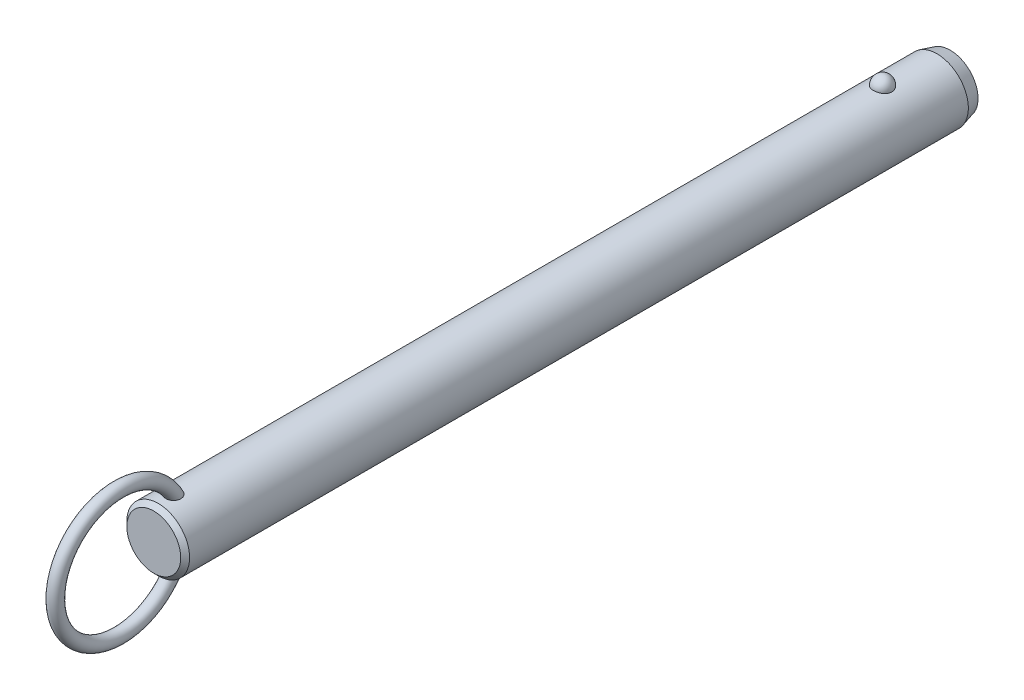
ISO-10303-21;
HEADER;
FILE_DESCRIPTION(('STEP AP214'),'2;1');
FILE_NAME('part.step','',(''),(''),'','','');
FILE_SCHEMA(('AUTOMOTIVE_DESIGN { 1 0 10303 214 1 1 1 1 }'));
ENDSEC;
DATA;
#1=APPLICATION_CONTEXT('core data for automotive mechanical design processes');
#2=APPLICATION_PROTOCOL_DEFINITION('international standard','automotive_design',2000,#1);
#3=PRODUCT_CONTEXT('',#1,'mechanical');
#4=PRODUCT('Part','Part','',(#3));
#5=PRODUCT_RELATED_PRODUCT_CATEGORY('part','',(#4));
#6=PRODUCT_DEFINITION_FORMATION('','',#4);
#7=PRODUCT_DEFINITION_CONTEXT('part definition',#1,'design');
#8=PRODUCT_DEFINITION('design','',#6,#7);
#9=PRODUCT_DEFINITION_SHAPE('','',#8);
#10=(LENGTH_UNIT() NAMED_UNIT(*) SI_UNIT(.MILLI.,.METRE.));
#11=(NAMED_UNIT(*) PLANE_ANGLE_UNIT() SI_UNIT($,.RADIAN.));
#12=(NAMED_UNIT(*) SI_UNIT($,.STERADIAN.) SOLID_ANGLE_UNIT());
#13=UNCERTAINTY_MEASURE_WITH_UNIT(LENGTH_MEASURE(1.E-05),#10,'distance_accuracy_value','');
#14=(GEOMETRIC_REPRESENTATION_CONTEXT(3) GLOBAL_UNCERTAINTY_ASSIGNED_CONTEXT((#13)) GLOBAL_UNIT_ASSIGNED_CONTEXT((#10,
#11,#12)) REPRESENTATION_CONTEXT('',''));
#15=CARTESIAN_POINT('',(0.,0.,0.));
#16=DIRECTION('',(0.,0.,1.));
#17=DIRECTION('',(1.,0.,0.));
#18=AXIS2_PLACEMENT_3D('',#15,#16,#17);
#19=CARTESIAN_POINT('',(0.,0.,154.9));
#20=DIRECTION('',(0.,0.,-1.));
#21=DIRECTION('',(-1.,0.,0.));
#22=AXIS2_PLACEMENT_3D('',#19,#20,#21);
#23=CYLINDRICAL_SURFACE('',#22,7.1);
#24=CARTESIAN_POINT('',(2.0769088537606,6.78943661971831,-2.1));
#25=CARTESIAN_POINT('',(2.07690739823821,6.78943796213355,-1.98268154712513));
#26=CARTESIAN_POINT('',(2.06738130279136,6.79237331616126,-1.86534506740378));
#27=CARTESIAN_POINT('',(2.0295040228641,6.8037853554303,-1.63400788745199));
#28=CARTESIAN_POINT('',(2.00114757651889,6.81226358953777,-1.52000812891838));
#29=CARTESIAN_POINT('',(1.92632025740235,6.83379798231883,-1.29863433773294));
#30=CARTESIAN_POINT('',(1.87985726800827,6.84685214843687,-1.19125744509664));
#31=CARTESIAN_POINT('',(1.76995205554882,6.87608091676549,-0.98604657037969));
#32=CARTESIAN_POINT('',(1.70650980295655,6.8922555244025,-0.88821260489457));
#33=CARTESIAN_POINT('',(1.5638119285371,6.92602930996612,-0.704242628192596));
#34=CARTESIAN_POINT('',(1.4844714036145,6.94363582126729,-0.618173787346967));
#35=CARTESIAN_POINT('',(1.31221746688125,6.97823658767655,-0.460740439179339));
#36=CARTESIAN_POINT('',(1.21930409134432,6.99523084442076,-0.389375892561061));
#37=CARTESIAN_POINT('',(1.02268781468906,7.02666176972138,-0.263547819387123));
#38=CARTESIAN_POINT('',(0.91902009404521,7.04110638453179,-0.209031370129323));
#39=CARTESIAN_POINT('',(0.703548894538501,7.06588726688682,-0.118163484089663));
#40=CARTESIAN_POINT('',(0.591746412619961,7.07622403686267,-0.0818098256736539));
#41=CARTESIAN_POINT('',(0.365557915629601,7.09147068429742,-0.0288711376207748));
#42=CARTESIAN_POINT('',(0.251267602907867,7.09648447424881,-0.0119070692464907));
#43=CARTESIAN_POINT('',(0.0213499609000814,7.10089837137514,0.00304925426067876));
#44=CARTESIAN_POINT('',(-0.0942772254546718,7.10029907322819,0.00104351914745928));
#45=CARTESIAN_POINT('',(-0.321651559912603,7.09360829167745,-0.0216931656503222));
#46=CARTESIAN_POINT('',(-0.433431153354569,7.08760388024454,-0.0421272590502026));
#47=CARTESIAN_POINT('',(-0.651862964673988,7.07086131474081,-0.100729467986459));
#48=CARTESIAN_POINT('',(-0.758515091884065,7.06012307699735,-0.138897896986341));
#49=CARTESIAN_POINT('',(-0.964449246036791,7.03496097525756,-0.232213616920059));
#50=CARTESIAN_POINT('',(-1.06368095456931,7.02051445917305,-0.287465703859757));
#51=CARTESIAN_POINT('',(-1.25145353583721,6.98948740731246,-0.413383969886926));
#52=CARTESIAN_POINT('',(-1.33999321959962,6.97290663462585,-0.48405186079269));
#53=CARTESIAN_POINT('',(-1.50591604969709,6.93898770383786,-0.640594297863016));
#54=CARTESIAN_POINT('',(-1.58302488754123,6.92164094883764,-0.726757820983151));
#55=CARTESIAN_POINT('',(-1.72189320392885,6.8884103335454,-0.91092752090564));
#56=CARTESIAN_POINT('',(-1.78365144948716,6.87252659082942,-1.008934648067));
#57=CARTESIAN_POINT('',(-1.89101272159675,6.84377189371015,-1.21549497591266));
#58=CARTESIAN_POINT('',(-1.93639553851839,6.83094274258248,-1.32416860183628));
#59=CARTESIAN_POINT('',(-2.00874275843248,6.81002070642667,-1.54791500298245));
#60=CARTESIAN_POINT('',(-2.03570774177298,6.80192767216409,-1.66298757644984));
#61=CARTESIAN_POINT('',(-2.07047276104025,6.7914266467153,-1.89571453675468));
#62=CARTESIAN_POINT('',(-2.07835878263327,6.78899315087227,-2.01335491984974));
#63=CARTESIAN_POINT('',(-2.07502083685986,6.79001409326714,-2.24833570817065));
#64=CARTESIAN_POINT('',(-2.06379746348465,6.7934683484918,-2.36567612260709));
#65=CARTESIAN_POINT('',(-2.02263913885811,6.80583442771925,-2.59603194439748));
#66=CARTESIAN_POINT('',(-1.99281127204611,6.81471501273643,-2.70906820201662));
#67=CARTESIAN_POINT('',(-1.91526639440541,6.83691232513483,-2.92836575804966));
#68=CARTESIAN_POINT('',(-1.8675486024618,6.85022924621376,-3.03462676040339));
#69=CARTESIAN_POINT('',(-1.75504492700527,6.87991336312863,-3.23806487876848));
#70=CARTESIAN_POINT('',(-1.69015924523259,6.89629822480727,-3.33518422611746));
#71=CARTESIAN_POINT('',(-1.54505404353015,6.93024852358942,-3.51697105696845));
#72=CARTESIAN_POINT('',(-1.46483385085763,6.94781401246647,-3.60163799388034));
#73=CARTESIAN_POINT('',(-1.29071406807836,6.98225977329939,-3.75654119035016));
#74=CARTESIAN_POINT('',(-1.19675650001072,6.99913673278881,-3.82671308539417));
#75=CARTESIAN_POINT('',(-0.997940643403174,7.03023618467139,-3.9501837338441));
#76=CARTESIAN_POINT('',(-0.89308318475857,7.04445887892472,-4.00348377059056));
#77=CARTESIAN_POINT('',(-0.676902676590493,7.06848365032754,-4.09107242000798));
#78=CARTESIAN_POINT('',(-0.565686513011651,7.0783430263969,-4.12560889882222));
#79=CARTESIAN_POINT('',(-0.338739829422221,7.09282534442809,-4.17575450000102));
#80=CARTESIAN_POINT('',(-0.223009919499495,7.09744899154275,-4.19136617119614));
#81=CARTESIAN_POINT('',(0.00707628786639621,7.10090930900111,-4.20307965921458));
#82=CARTESIAN_POINT('',(0.121410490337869,7.09986531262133,-4.19958377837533));
#83=CARTESIAN_POINT('',(0.347815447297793,7.092380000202,-4.17411564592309));
#84=CARTESIAN_POINT('',(0.459886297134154,7.08593891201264,-4.15214417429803));
#85=CARTESIAN_POINT('',(0.678084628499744,7.06838983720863,-4.09049562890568));
#86=CARTESIAN_POINT('',(0.784237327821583,7.05730369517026,-4.05090137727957));
#87=CARTESIAN_POINT('',(0.988305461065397,7.03163139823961,-3.95511447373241));
#88=CARTESIAN_POINT('',(1.08622031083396,7.01704499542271,-3.89892064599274));
#89=CARTESIAN_POINT('',(1.27284490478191,6.98562668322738,-3.77035541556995));
#90=CARTESIAN_POINT('',(1.36137372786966,6.96876135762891,-3.69772964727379));
#91=CARTESIAN_POINT('',(1.52509486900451,6.93477412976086,-3.53878279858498));
#92=CARTESIAN_POINT('',(1.60028496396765,6.91765218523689,-3.45245943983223));
#93=CARTESIAN_POINT('',(1.73681688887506,6.88465753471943,-3.26658774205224));
#94=CARTESIAN_POINT('',(1.79785966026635,6.86881574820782,-3.16681408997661));
#95=CARTESIAN_POINT('',(1.90265327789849,6.84053157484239,-2.95814408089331));
#96=CARTESIAN_POINT('',(1.94640861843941,6.82808830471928,-2.84925010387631));
#97=CARTESIAN_POINT('',(2.01274378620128,6.80881460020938,-2.63454318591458));
#98=CARTESIAN_POINT('',(2.03676193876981,6.80160856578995,-2.52920574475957));
#99=CARTESIAN_POINT('',(2.06884490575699,6.79191902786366,-2.3159172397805));
#100=CARTESIAN_POINT('',(2.07691019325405,6.78943538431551,-2.20796625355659));
#101=CARTESIAN_POINT('',(2.0769088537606,6.78943661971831,-2.1));
#102=B_SPLINE_CURVE_WITH_KNOTS('',3,(#24,#25,#26,#27,#28,#29,#30,#31,#32,#33,#34,#35,#36,#37,
#38,#39,#40,#41,#42,#43,#44,#45,#46,#47,#48,#49,#50,#51,#52,#53,#54,#55,#56,#57,#58,#59,#60,#61,
#62,#63,#64,#65,#66,#67,#68,#69,#70,#71,#72,#73,#74,#75,#76,#77,#78,#79,#80,#81,#82,#83,#84,#85,
#86,#87,#88,#89,#90,#91,#92,#93,#94,#95,#96,#97,#98,#99,#100,#101),.UNSPECIFIED.,.T.,.F.,(4,2,2,
2,2,2,2,2,2,2,2,2,2,2,2,2,2,2,2,2,2,2,2,2,2,2,2,2,2,2,2,2,2,2,2,2,2,2,4),(0.,0.351568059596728,
0.703234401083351,1.05474780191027,1.40626181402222,1.75970563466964,2.11314851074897,
2.4654696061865,2.81774759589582,3.16301449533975,3.50824481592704,3.84801136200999,
4.18778391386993,4.52968352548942,4.87162112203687,5.22076181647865,5.56993054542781,
5.92363364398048,6.27732559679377,6.62942052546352,6.98150450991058,7.33158042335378,
7.68167162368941,8.03384443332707,8.38603269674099,8.73975272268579,9.09344583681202,
9.44234545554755,9.79119807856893,10.1327344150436,10.4742563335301,10.8141898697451,
11.1541474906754,11.4997793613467,11.8454687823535,12.1979079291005,12.5502553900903,
12.8738073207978,13.1973496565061),.UNSPECIFIED.);
#103=CARTESIAN_POINT('',(2.0769088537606,6.78943661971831,-2.1));
#104=VERTEX_POINT('',#103);
#105=EDGE_CURVE('E41',#104,#104,#102,.T.);
#106=ORIENTED_EDGE('',*,*,#105,.T.);
#107=EDGE_LOOP('',(#106));
#108=FACE_BOUND('',#107,.T.);
#109=CARTESIAN_POINT('',(0.,0.,161.82));
#110=DIRECTION('',(0.,0.,1.));
#111=DIRECTION('',(1.,0.,0.));
#112=AXIS2_PLACEMENT_3D('',#109,#110,#111);
#113=CIRCLE('',#112,7.1);
#114=CARTESIAN_POINT('',(7.1,0.,161.82));
#115=VERTEX_POINT('',#114);
#116=EDGE_CURVE('E10',#115,#115,#113,.F.);
#117=ORIENTED_EDGE('',*,*,#116,.T.);
#118=EDGE_LOOP('',(#117));
#119=FACE_BOUND('',#118,.T.);
#120=CARTESIAN_POINT('',(-0.429539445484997,-7.08699541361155,156.642921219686));
#121=CARTESIAN_POINT('',(-0.508331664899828,-7.08221999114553,156.666876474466));
#122=CARTESIAN_POINT('',(-0.585039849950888,-7.07624016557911,156.697457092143));
#123=CARTESIAN_POINT('',(-0.73208265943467,-7.06254296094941,156.771024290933));
#124=CARTESIAN_POINT('',(-0.802417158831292,-7.05482554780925,156.814011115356));
#125=CARTESIAN_POINT('',(-0.934722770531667,-7.03851844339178,156.911113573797));
#126=CARTESIAN_POINT('',(-0.996700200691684,-7.02992941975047,156.965220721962));
#127=CARTESIAN_POINT('',(-1.11079942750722,-7.01280697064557,157.082967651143));
#128=CARTESIAN_POINT('',(-1.16292136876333,-7.00427354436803,157.146607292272));
#129=CARTESIAN_POINT('',(-1.25705660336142,-6.98799959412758,157.282687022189));
#130=CARTESIAN_POINT('',(-1.29888032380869,-6.98027525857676,157.355259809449));
#131=CARTESIAN_POINT('',(-1.37069920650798,-6.96652886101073,157.506168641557));
#132=CARTESIAN_POINT('',(-1.40069157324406,-6.96050720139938,157.584506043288));
#133=CARTESIAN_POINT('',(-1.45043507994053,-6.95031881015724,157.750190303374));
#134=CARTESIAN_POINT('',(-1.46937115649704,-6.94630231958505,157.837789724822));
#135=CARTESIAN_POINT('',(-1.49424917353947,-6.94099239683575,158.014871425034));
#136=CARTESIAN_POINT('',(-1.50018601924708,-6.93970003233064,158.104354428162));
#137=CARTESIAN_POINT('',(-1.49978214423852,-6.93978815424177,158.294060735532));
#138=CARTESIAN_POINT('',(-1.49187639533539,-6.94150934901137,158.394279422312));
#139=CARTESIAN_POINT('',(-1.46177925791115,-6.94790814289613,158.592479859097));
#140=CARTESIAN_POINT('',(-1.43957541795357,-6.95258831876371,158.690459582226));
#141=CARTESIAN_POINT('',(-1.37783293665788,-6.96510647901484,158.89536292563));
#142=CARTESIAN_POINT('',(-1.33634073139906,-6.97328848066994,159.001680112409));
#143=CARTESIAN_POINT('',(-1.23686994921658,-6.99161706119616,159.206177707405));
#144=CARTESIAN_POINT('',(-1.17889192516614,-7.00176357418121,159.304358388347));
#145=CARTESIAN_POINT('',(-1.0587512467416,-7.02082898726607,159.472374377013));
#146=CARTESIAN_POINT('',(-0.999247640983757,-7.02963746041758,159.544123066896));
#147=CARTESIAN_POINT('',(-0.869494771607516,-7.04686074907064,159.677195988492));
#148=CARTESIAN_POINT('',(-0.799263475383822,-7.05527619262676,159.738537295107));
#149=CARTESIAN_POINT('',(-0.665408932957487,-7.06899457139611,159.835131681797));
#150=CARTESIAN_POINT('',(-0.603817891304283,-7.07457275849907,159.873151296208));
#151=CARTESIAN_POINT('',(-0.475172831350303,-7.08437420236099,159.938758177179));
#152=CARTESIAN_POINT('',(-0.408123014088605,-7.08859848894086,159.966353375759));
#153=CARTESIAN_POINT('',(-0.269431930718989,-7.09522749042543,160.009256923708));
#154=CARTESIAN_POINT('',(-0.197757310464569,-7.09761688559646,160.024461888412));
#155=CARTESIAN_POINT('',(-0.0527849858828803,-7.10017268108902,160.040716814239));
#156=CARTESIAN_POINT('',(0.0205115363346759,-7.10034065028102,160.041776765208));
#157=CARTESIAN_POINT('',(0.156426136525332,-7.09855986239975,160.030461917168));
#158=CARTESIAN_POINT('',(0.219199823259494,-7.09688191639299,160.019806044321));
#159=CARTESIAN_POINT('',(0.342134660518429,-7.09201880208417,159.988537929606));
#160=CARTESIAN_POINT('',(0.402295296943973,-7.08883333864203,159.967923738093));
#161=CARTESIAN_POINT('',(0.520687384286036,-7.08113868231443,159.917212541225));
#162=CARTESIAN_POINT('',(0.578791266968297,-7.07658958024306,159.886827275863));
#163=CARTESIAN_POINT('',(0.690173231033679,-7.06659708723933,159.818367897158));
#164=CARTESIAN_POINT('',(0.743447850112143,-7.061153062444,159.780288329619));
#165=CARTESIAN_POINT('',(0.870947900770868,-7.04680292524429,159.676592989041));
#166=CARTESIAN_POINT('',(0.941828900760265,-7.03755800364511,159.606897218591));
#167=CARTESIAN_POINT('',(1.07136606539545,-7.01900793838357,159.456945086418));
#168=CARTESIAN_POINT('',(1.13000013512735,-7.00970271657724,159.376670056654));
#169=CARTESIAN_POINT('',(1.23579584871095,-6.99183327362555,159.206899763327));
#170=CARTESIAN_POINT('',(1.28274271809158,-6.98328455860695,159.117269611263));
#171=CARTESIAN_POINT('',(1.36351442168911,-6.96796352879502,158.932176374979));
#172=CARTESIAN_POINT('',(1.39733971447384,-6.96119115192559,158.836713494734));
#173=CARTESIAN_POINT('',(1.45579181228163,-6.94922464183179,158.62530928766));
#174=CARTESIAN_POINT('',(1.47790145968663,-6.94449000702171,158.508631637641));
#175=CARTESIAN_POINT('',(1.50168752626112,-6.93938731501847,158.273015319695));
#176=CARTESIAN_POINT('',(1.50336085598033,-6.93901991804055,158.15407631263));
#177=CARTESIAN_POINT('',(1.48486516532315,-6.9430010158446,157.92360799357));
#178=CARTESIAN_POINT('',(1.46573441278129,-6.9471253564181,157.811995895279));
#179=CARTESIAN_POINT('',(1.40606892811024,-6.95944667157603,157.594886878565));
#180=CARTESIAN_POINT('',(1.36556446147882,-6.96763788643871,157.4893815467));
#181=CARTESIAN_POINT('',(1.2708270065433,-6.98548038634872,157.304287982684));
#182=CARTESIAN_POINT('',(1.21949810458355,-6.99473841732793,157.223171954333));
#183=CARTESIAN_POINT('',(1.10242050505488,-7.01414069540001,157.072227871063));
#184=CARTESIAN_POINT('',(1.03668119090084,-7.02428436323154,157.00239252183));
#185=CARTESIAN_POINT('',(0.90055902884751,-7.04295285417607,156.883573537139));
#186=CARTESIAN_POINT('',(0.831428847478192,-7.05153466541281,156.833157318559));
#187=CARTESIAN_POINT('',(0.685291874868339,-7.06723150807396,156.745142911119));
#188=CARTESIAN_POINT('',(0.608287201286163,-7.07434693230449,156.707541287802));
#189=CARTESIAN_POINT('',(0.451878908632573,-7.08602232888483,156.647491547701));
#190=CARTESIAN_POINT('',(0.37268652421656,-7.09067127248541,156.624508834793));
#191=CARTESIAN_POINT('',(0.211477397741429,-7.09730788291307,156.592035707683));
#192=CARTESIAN_POINT('',(0.129460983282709,-7.09929585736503,156.58254373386));
#193=CARTESIAN_POINT('',(-0.0332905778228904,-7.10037858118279,156.577351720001));
#194=CARTESIAN_POINT('',(-0.114016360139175,-7.09953334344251,156.581365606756));
#195=CARTESIAN_POINT('',(-0.273670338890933,-7.09517338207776,156.602454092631));
#196=CARTESIAN_POINT('',(-0.352598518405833,-7.09165863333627,156.619528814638));
#197=CARTESIAN_POINT('',(-0.429539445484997,-7.08699541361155,156.642921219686));
#198=B_SPLINE_CURVE_WITH_KNOTS('',3,(#120,#121,#122,#123,#124,#125,#126,#127,#128,#129,#130,
#131,#132,#133,#134,#135,#136,#137,#138,#139,#140,#141,#142,#143,#144,#145,#146,#147,#148,#149,
#150,#151,#152,#153,#154,#155,#156,#157,#158,#159,#160,#161,#162,#163,#164,#165,#166,#167,#168,
#169,#170,#171,#172,#173,#174,#175,#176,#177,#178,#179,#180,#181,#182,#183,#184,#185,#186,#187,
#188,#189,#190,#191,#192,#193,#194,#195,#196,#197),.UNSPECIFIED.,.T.,.F.,(4,2,2,2,2,2,2,2,2,2,2,
2,2,2,2,2,2,2,2,2,2,2,2,2,2,2,2,2,2,2,2,2,2,2,2,2,2,2,4),(0.,0.247183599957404,
0.494372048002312,0.741372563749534,0.988369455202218,1.23962059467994,1.490931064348,
1.75897818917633,2.02713035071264,2.3275826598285,2.62829697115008,2.97008736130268,
3.31186629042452,3.59175319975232,3.87117637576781,4.08813841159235,4.30493502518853,
4.5235225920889,4.74195577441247,4.93215328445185,5.12238804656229,5.31884850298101,
5.51544871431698,5.81332317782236,6.11173048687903,6.41527266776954,6.71880423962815,
7.07358156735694,7.42841252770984,7.76631485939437,8.10373999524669,8.39142246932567,
8.67891817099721,8.93560332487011,9.19221962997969,9.43881106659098,9.68537399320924,
9.92674752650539,10.1681233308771),.UNSPECIFIED.);
#199=CARTESIAN_POINT('',(-0.429539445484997,-7.08699541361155,156.642921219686));
#200=VERTEX_POINT('',#199);
#201=EDGE_CURVE('E59',#200,#200,#198,.T.);
#202=ORIENTED_EDGE('',*,*,#201,.T.);
#203=EDGE_LOOP('',(#202));
#204=FACE_BOUND('',#203,.T.);
#205=CARTESIAN_POINT('',(-0.429539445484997,7.08699541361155,156.642921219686));
#206=CARTESIAN_POINT('',(-0.35166550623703,7.09171429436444,156.619246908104));
#207=CARTESIAN_POINT('',(-0.271733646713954,7.09525896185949,156.602036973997));
#208=CARTESIAN_POINT('',(-0.110026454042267,7.09960839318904,156.581005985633));
#209=CARTESIAN_POINT('',(-0.0282502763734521,7.10041187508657,156.577191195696));
#210=CARTESIAN_POINT('',(0.134782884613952,7.09918849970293,156.583059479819));
#211=CARTESIAN_POINT('',(0.216039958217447,7.09716214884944,156.59274013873));
#212=CARTESIAN_POINT('',(0.375730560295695,7.09050177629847,156.625347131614));
#213=CARTESIAN_POINT('',(0.454164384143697,7.08586802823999,156.648272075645));
#214=CARTESIAN_POINT('',(0.606025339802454,7.07449911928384,156.706771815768));
#215=CARTESIAN_POINT('',(0.67945100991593,7.06776334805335,156.742350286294));
#216=CARTESIAN_POINT('',(0.819234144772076,7.05292866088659,156.825175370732));
#217=CARTESIAN_POINT('',(0.88559181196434,7.04482978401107,156.872421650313));
#218=CARTESIAN_POINT('',(1.00993211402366,7.02808709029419,156.977590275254));
#219=CARTESIAN_POINT('',(1.06785399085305,7.01943990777,157.035583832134));
#220=CARTESIAN_POINT('',(1.17342527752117,7.00256662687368,157.160301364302));
#221=CARTESIAN_POINT('',(1.22107408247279,6.99434055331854,157.227025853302));
#222=CARTESIAN_POINT('',(1.30652927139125,6.97889183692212,157.369362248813));
#223=CARTESIAN_POINT('',(1.34399711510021,6.97170674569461,157.445180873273));
#224=CARTESIAN_POINT('',(1.40682616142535,6.95930080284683,157.601810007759));
#225=CARTESIAN_POINT('',(1.43218374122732,6.95408053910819,157.68262200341));
#226=CARTESIAN_POINT('',(1.47246409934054,6.94566853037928,157.853531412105));
#227=CARTESIAN_POINT('',(1.48642590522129,6.9426653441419,157.94386307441));
#228=CARTESIAN_POINT('',(1.5011410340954,6.93949744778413,158.125619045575));
#229=CARTESIAN_POINT('',(1.50188917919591,6.93933385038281,158.217043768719));
#230=CARTESIAN_POINT('',(1.49030464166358,6.94183245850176,158.41084381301));
#231=CARTESIAN_POINT('',(1.47627413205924,6.94486147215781,158.513112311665));
#232=CARTESIAN_POINT('',(1.43356351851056,6.95380194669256,158.714471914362));
#233=CARTESIAN_POINT('',(1.4048676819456,6.95971650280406,158.813559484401));
#234=CARTESIAN_POINT('',(1.32908750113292,6.97461208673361,159.018908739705));
#235=CARTESIAN_POINT('',(1.28011435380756,6.98388945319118,159.124456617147));
#236=CARTESIAN_POINT('',(1.16520357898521,7.00397743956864,159.325760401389));
#237=CARTESIAN_POINT('',(1.09927694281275,7.01478706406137,159.421522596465));
#238=CARTESIAN_POINT('',(0.969361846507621,7.03373936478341,159.576756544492));
#239=CARTESIAN_POINT('',(0.909042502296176,7.04187023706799,159.639303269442));
#240=CARTESIAN_POINT('',(0.779178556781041,7.05741732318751,159.754053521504));
#241=CARTESIAN_POINT('',(0.709649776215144,7.06483472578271,159.806274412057));
#242=CARTESIAN_POINT('',(0.576854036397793,7.0767751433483,159.888113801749));
#243=CARTESIAN_POINT('',(0.515118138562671,7.08158033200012,159.920164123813));
#244=CARTESIAN_POINT('',(0.387127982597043,7.08972701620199,159.973765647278));
#245=CARTESIAN_POINT('',(0.320877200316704,7.09306962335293,159.995324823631));
#246=CARTESIAN_POINT('',(0.185041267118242,7.09791507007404,160.026400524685));
#247=CARTESIAN_POINT('',(0.115437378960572,7.09940591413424,160.035838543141));
#248=CARTESIAN_POINT('',(-0.0243157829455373,7.10030171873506,160.041522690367));
#249=CARTESIAN_POINT('',(-0.0944648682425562,7.0997073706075,160.037773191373));
#250=CARTESIAN_POINT('',(-0.225713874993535,7.09668414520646,160.018508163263));
#251=CARTESIAN_POINT('',(-0.287006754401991,7.09444865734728,160.004232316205));
#252=CARTESIAN_POINT('',(-0.406555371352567,7.08860360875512,159.966368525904));
#253=CARTESIAN_POINT('',(-0.464809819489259,7.08499346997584,159.942776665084));
#254=CARTESIAN_POINT('',(-0.594955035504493,7.07541654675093,159.878923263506));
#255=CARTESIAN_POINT('',(-0.665389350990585,7.06906574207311,159.835753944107));
#256=CARTESIAN_POINT('',(-0.798242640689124,7.05530261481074,159.738587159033));
#257=CARTESIAN_POINT('',(-0.860645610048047,7.0478882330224,159.684568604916));
#258=CARTESIAN_POINT('',(-0.994249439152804,7.03045217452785,159.550996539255));
#259=CARTESIAN_POINT('',(-1.06260129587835,7.02030745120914,159.468614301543));
#260=CARTESIAN_POINT('',(-1.18502045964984,7.00068382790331,159.293843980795));
#261=CARTESIAN_POINT('',(-1.23907684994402,6.99120544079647,159.201448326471));
#262=CARTESIAN_POINT('',(-1.33335589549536,6.97384343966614,159.008008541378));
#263=CARTESIAN_POINT('',(-1.37336138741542,6.96598557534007,158.906856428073));
#264=CARTESIAN_POINT('',(-1.43770677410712,6.95299053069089,158.699504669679));
#265=CARTESIAN_POINT('',(-1.46204473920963,6.94785368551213,158.59330440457));
#266=CARTESIAN_POINT('',(-1.49537533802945,6.94076296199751,158.368231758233));
#267=CARTESIAN_POINT('',(-1.50273564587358,6.93914842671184,158.24909751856));
#268=CARTESIAN_POINT('',(-1.4954555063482,6.94072368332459,158.011470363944));
#269=CARTESIAN_POINT('',(-1.48082914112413,6.94391040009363,157.892977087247));
#270=CARTESIAN_POINT('',(-1.43076401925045,6.95438579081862,157.673432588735));
#271=CARTESIAN_POINT('',(-1.39762227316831,6.96121852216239,157.571841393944));
#272=CARTESIAN_POINT('',(-1.31211274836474,6.97783941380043,157.377351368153));
#273=CARTESIAN_POINT('',(-1.25976607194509,6.98762432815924,157.28444313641));
#274=CARTESIAN_POINT('',(-1.14583073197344,7.00713153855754,157.124160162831));
#275=CARTESIAN_POINT('',(-1.08665947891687,7.01665982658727,157.055035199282));
#276=CARTESIAN_POINT('',(-0.95660664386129,7.03556646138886,156.928878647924));
#277=CARTESIAN_POINT('',(-0.885737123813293,7.04494495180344,156.871834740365));
#278=CARTESIAN_POINT('',(-0.7515580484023,7.06035735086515,156.783100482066));
#279=CARTESIAN_POINT('',(-0.690120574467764,7.0666695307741,156.748593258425));
#280=CARTESIAN_POINT('',(-0.562815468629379,7.07794609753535,156.688750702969));
#281=CARTESIAN_POINT('',(-0.496948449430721,7.08291067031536,156.663414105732));
#282=CARTESIAN_POINT('',(-0.429539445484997,7.08699541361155,156.642921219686));
#283=B_SPLINE_CURVE_WITH_KNOTS('',3,(#205,#206,#207,#208,#209,#210,#211,#212,#213,#214,#215,
#216,#217,#218,#219,#220,#221,#222,#223,#224,#225,#226,#227,#228,#229,#230,#231,#232,#233,#234,
#235,#236,#237,#238,#239,#240,#241,#242,#243,#244,#245,#246,#247,#248,#249,#250,#251,#252,#253,
#254,#255,#256,#257,#258,#259,#260,#261,#262,#263,#264,#265,#266,#267,#268,#269,#270,#271,#272,
#273,#274,#275,#276,#277,#278,#279,#280,#281,#282),.UNSPECIFIED.,.T.,.F.,(4,2,2,2,2,2,2,2,2,2,2,
2,2,2,2,2,2,2,2,2,2,2,2,2,2,2,2,2,2,2,2,2,2,2,2,2,2,2,4),(0.,0.244335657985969,
0.488785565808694,0.733191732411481,0.977572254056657,1.2220237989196,1.46646834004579,
1.71259457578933,1.9587352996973,2.21226768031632,2.46587585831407,2.73913816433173,
3.01250754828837,3.32109936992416,3.63002293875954,3.9786351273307,4.32702187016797,
4.58793945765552,4.84841449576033,5.05676704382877,5.26496096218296,5.47449661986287,
5.68396281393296,5.87205447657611,6.06022532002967,6.30743751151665,6.55513496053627,
6.87602468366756,7.1971587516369,7.52305774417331,7.84899686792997,8.2051615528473,
8.56109821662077,8.88040084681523,9.19935367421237,9.47236282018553,9.74509220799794,
9.95662250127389,10.1681235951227),.UNSPECIFIED.);
#284=CARTESIAN_POINT('',(-0.429539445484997,7.08699541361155,156.642921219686));
#285=VERTEX_POINT('',#284);
#286=EDGE_CURVE('E67',#285,#285,#283,.T.);
#287=ORIENTED_EDGE('',*,*,#286,.T.);
#288=EDGE_LOOP('',(#287));
#289=FACE_BOUND('',#288,.T.);
#290=CARTESIAN_POINT('',(0.,0.,-14.4));
#291=DIRECTION('',(0.,0.,-1.));
#292=DIRECTION('',(-1.,0.,0.));
#293=AXIS2_PLACEMENT_3D('',#290,#291,#292);
#294=CIRCLE('',#293,7.1);
#295=CARTESIAN_POINT('',(-7.1,0.,-14.4));
#296=VERTEX_POINT('',#295);
#297=EDGE_CURVE('E56',#296,#296,#294,.F.);
#298=ORIENTED_EDGE('',*,*,#297,.T.);
#299=EDGE_LOOP('',(#298));
#300=FACE_BOUND('',#299,.T.);
#301=ADVANCED_FACE('F37',(#108,#119,#204,#289,#300),#23,.T.);
#302=CARTESIAN_POINT('',(0.,0.,-17.4));
#303=DIRECTION('',(0.,0.,-1.));
#304=DIRECTION('',(-1.,0.,0.));
#305=AXIS2_PLACEMENT_3D('',#302,#303,#304);
#306=PLANE('',#305);
#307=CARTESIAN_POINT('',(0.,0.,-17.4));
#308=DIRECTION('',(0.,0.,-1.));
#309=DIRECTION('',(-1.,0.,0.));
#310=AXIS2_PLACEMENT_3D('',#307,#308,#309);
#311=CIRCLE('',#310,6.29615242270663);
#312=CARTESIAN_POINT('',(-6.29615242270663,0.,-17.4));
#313=VERTEX_POINT('',#312);
#314=EDGE_CURVE('E66',#313,#313,#311,.T.);
#315=ORIENTED_EDGE('',*,*,#314,.T.);
#316=EDGE_LOOP('',(#315));
#317=FACE_BOUND('',#316,.T.);
#318=ADVANCED_FACE('F85',(#317),#306,.T.);
#319=CARTESIAN_POINT('',(0.,0.,-17.4));
#320=DIRECTION('',(0.,0.,1.));
#321=DIRECTION('',(1.,0.,0.));
#322=AXIS2_PLACEMENT_3D('',#319,#320,#321);
#323=CONICAL_SURFACE('',#322,6.29615242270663,0.261799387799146);
#324=ORIENTED_EDGE('',*,*,#297,.F.);
#325=EDGE_LOOP('',(#324));
#326=FACE_BOUND('',#325,.T.);
#327=ORIENTED_EDGE('',*,*,#314,.F.);
#328=EDGE_LOOP('',(#327));
#329=FACE_BOUND('',#328,.T.);
#330=ADVANCED_FACE('F83',(#326,#329),#323,.T.);
#331=CARTESIAN_POINT('',(0.,0.,162.82));
#332=DIRECTION('',(0.,0.,1.));
#333=DIRECTION('',(1.,0.,0.));
#334=AXIS2_PLACEMENT_3D('',#331,#332,#333);
#335=PLANE('',#334);
#336=CARTESIAN_POINT('',(0.,0.,162.82));
#337=DIRECTION('',(0.,0.,1.));
#338=DIRECTION('',(1.,0.,0.));
#339=AXIS2_PLACEMENT_3D('',#336,#337,#338);
#340=CIRCLE('',#339,6.09999999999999);
#341=CARTESIAN_POINT('',(6.09999999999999,0.,162.82));
#342=VERTEX_POINT('',#341);
#343=EDGE_CURVE('E50',#342,#342,#340,.T.);
#344=ORIENTED_EDGE('',*,*,#343,.T.);
#345=EDGE_LOOP('',(#344));
#346=FACE_BOUND('',#345,.T.);
#347=ADVANCED_FACE('F77',(#346),#335,.T.);
#348=CARTESIAN_POINT('',(0.,0.,170.75));
#349=DIRECTION('',(1.,0.,0.));
#350=DIRECTION('',(0.,0.,-1.));
#351=AXIS2_PLACEMENT_3D('',#348,#349,#350);
#352=TOROIDAL_SURFACE('',#351,14.35,1.5);
#353=ORIENTED_EDGE('',*,*,#286,.F.);
#354=EDGE_LOOP('',(#353));
#355=FACE_BOUND('',#354,.T.);
#356=ORIENTED_EDGE('',*,*,#201,.F.);
#357=EDGE_LOOP('',(#356));
#358=FACE_BOUND('',#357,.T.);
#359=ADVANCED_FACE('F73',(#355,#358),#352,.T.);
#360=CARTESIAN_POINT('',(0.,0.,162.82));
#361=DIRECTION('',(0.,0.,-1.));
#362=DIRECTION('',(-1.,0.,0.));
#363=AXIS2_PLACEMENT_3D('',#360,#361,#362);
#364=CONICAL_SURFACE('',#363,6.09999999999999,0.78539816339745);
#365=ORIENTED_EDGE('',*,*,#116,.F.);
#366=EDGE_LOOP('',(#365));
#367=FACE_BOUND('',#366,.T.);
#368=ORIENTED_EDGE('',*,*,#343,.F.);
#369=EDGE_LOOP('',(#368));
#370=FACE_BOUND('',#369,.T.);
#371=ADVANCED_FACE('F39',(#367,#370),#364,.T.);
#372=CARTESIAN_POINT('',(0.,7.1,-2.1));
#373=DIRECTION('',(0.,1.,0.));
#374=DIRECTION('',(0.,0.,1.));
#375=AXIS2_PLACEMENT_3D('',#372,#373,#374);
#376=SPHERICAL_SURFACE('',#375,2.10000000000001);
#377=ORIENTED_EDGE('',*,*,#105,.F.);
#378=EDGE_LOOP('',(#377));
#379=FACE_BOUND('',#378,.T.);
#380=ADVANCED_FACE('F79',(#379),#376,.T.);
#381=CLOSED_SHELL('',(#301,#318,#330,#347,#359,#371,#380));
#382=MANIFOLD_SOLID_BREP('B2',#381);
#383=ADVANCED_BREP_SHAPE_REPRESENTATION('',(#18,#382),#14);
#384=SHAPE_DEFINITION_REPRESENTATION(#9,#383);
ENDSEC;
END-ISO-10303-21;
